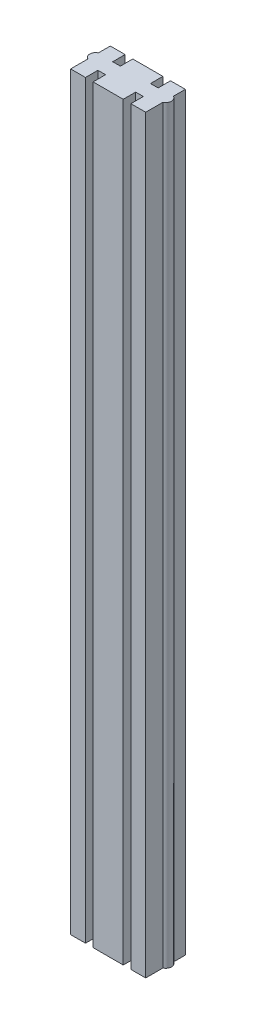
from build123d import *

# Parameters (mm, degrees)
BOSS_EXTRUDE1_DEPTH = 398.4625


with BuildPart() as part:
    # Sketch1 → Boss-Extrude1 (new body)
    with BuildSketch(Plane(origin=(0, 0, 0), x_dir=(1, 0, 0), z_dir=(0, 1, 0))):
        with BuildLine():
            Line((0, 0), (7.874, 0))
            Line((7.874, 0), (7.874, 6.604))
            Line((7.874, 6.604), (11.938, 6.604))
            Line((11.938, 6.604), (11.938, 0))
            Line((11.938, 0), (27.94, 0))
            Line((27.94, 0), (27.94, 6.604))
            Line((27.94, 6.604), (32.004, 6.604))
            Line((32.004, 6.604), (32.004, 0))
            Line((32.004, 0), (39.878, 0))
            Line((39.878, 0), (39.878, 9.167187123))
            ThreePointArc((39.878, 9.167187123), (41.656, 11.938), (39.878, 14.708812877))
            Line((39.878, 14.708812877), (39.878, 21.082))
            Line((39.878, 21.082), (32.004, 21.082))
            Line((32.004, 21.082), (32.004, 14.478))
            Line((32.004, 14.478), (27.94, 14.478))
            Line((27.94, 14.478), (27.94, 21.082))
            Line((27.94, 21.082), (11.938, 21.082))
            Line((11.938, 21.082), (11.938, 14.478))
            Line((11.938, 14.478), (7.874, 14.478))
            Line((7.874, 14.478), (7.874, 21.082))
            Line((7.874, 21.082), (0, 21.082))
            Line((0, 21.082), (0, 14.708812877))
            ThreePointArc((0, 14.708812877), (-1.778, 11.938), (0, 9.167187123))
            Line((0, 9.167187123), (0, 0))
        make_face()
    extrude(amount=BOSS_EXTRUDE1_DEPTH)


solid = part.part
